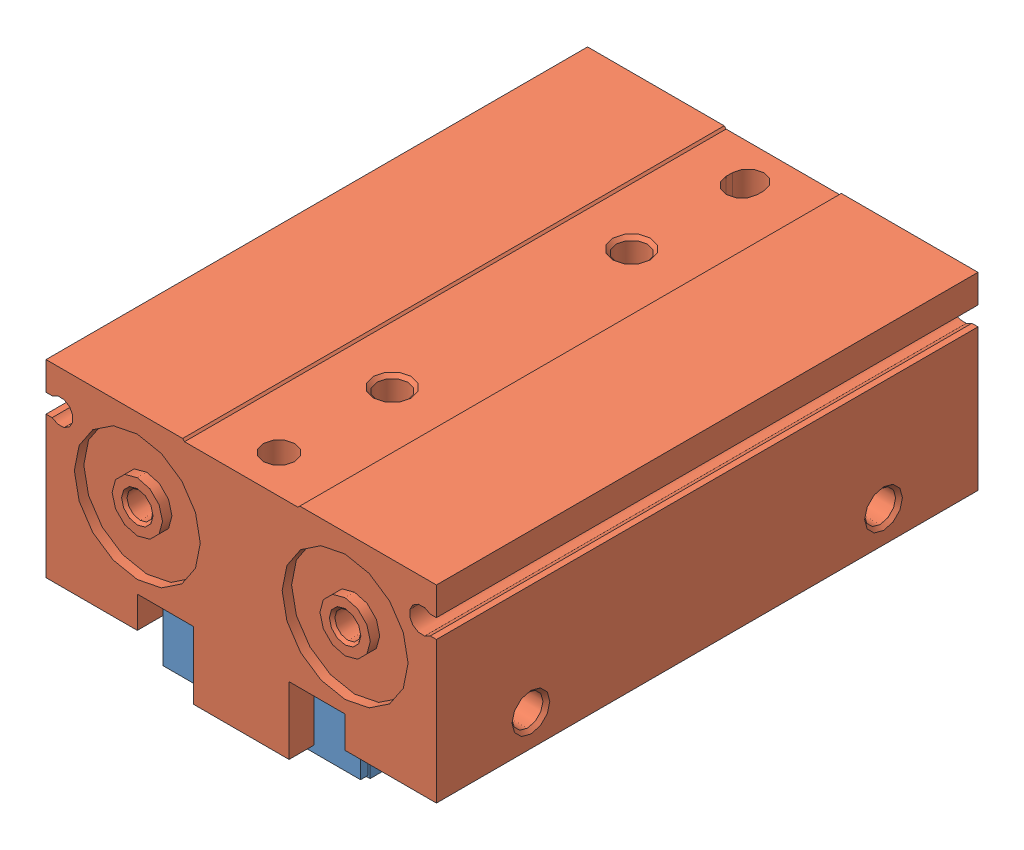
SolidWorks assembly SHF20-20D.sldasm, configuration Default (file format 11000). Lengths in mm.
Overall size (62 41 86.4).
3 component instances, 2 part files, 0 mates.
Components (placement in the parent):
- SHF20-02-3: SHF20-02.sldprt [Default] at (0 -41 -10) x (-1 0 0) z (0 0 -1) size (32 17.6 53.4)
- SHF20-02-2: SHF20-02.sldprt [Default] at (-0.6944 -37.0624 5.6513) size (32 17.6 53.4)
- SHF20-01-1: SHF20-01.sldprt [Default] at origin size (62 35.7 86)
